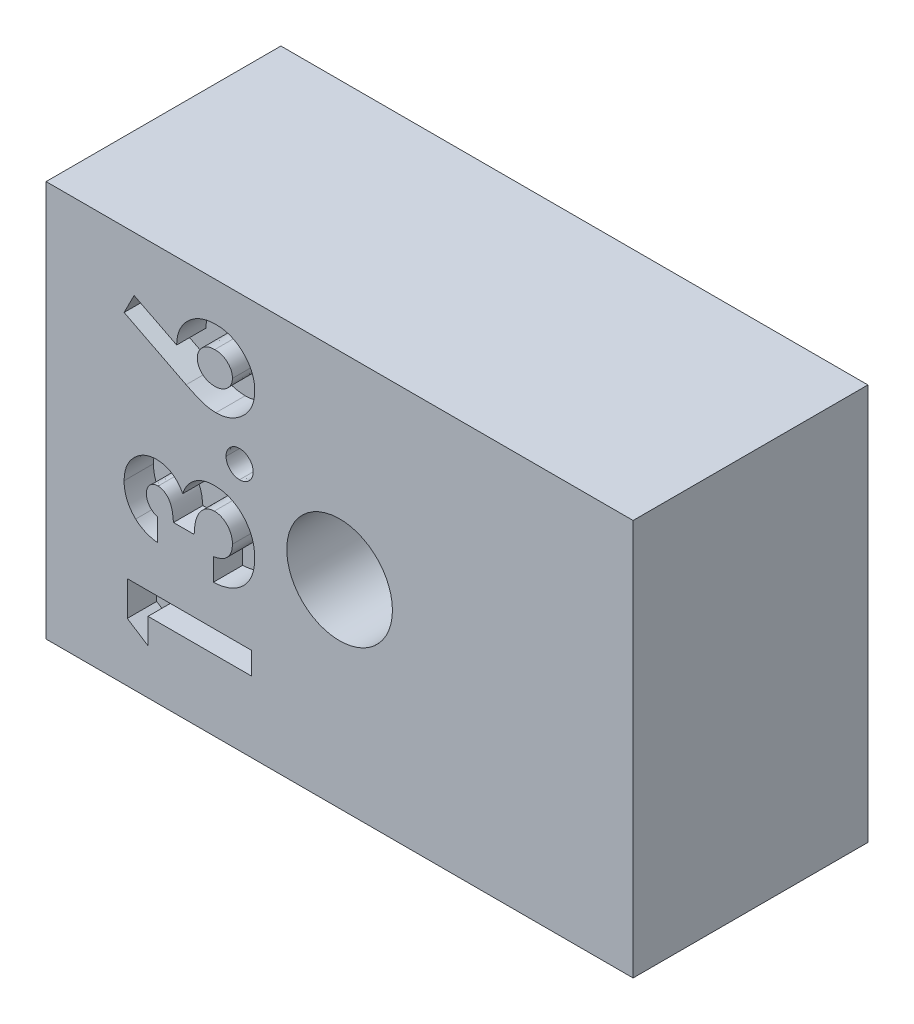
from build123d import *

# Parameters (mm, degrees)
SKETCH1_W           = 20
SKETCH1_H           = 13.5
SKETCH1_R           = 1.8
BOSS_EXTRUDE1_DEPTH = 8
CUT_EXTRUDE1_DEPTH  = 1


with BuildPart() as part:
    # Sketch1 → Boss-Extrude1 (new body)
    with BuildSketch(Plane.XY):
        with Locations((-2.245418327, -0.220916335)):
            Rectangle(SKETCH1_W, SKETCH1_H)
        with Locations((-2.245418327, -0.220916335)):
            Circle(SKETCH1_R, mode=Mode.SUBTRACT)
    extrude(amount=BOSS_EXTRUDE1_DEPTH)

    # Sketch3 → Cut-Extrude1 (cut)
    # profile 1 of 4: a face of its own
    with BuildSketch(Plane.XY.offset(8)):
        Polygon((-9.47875166, -4.97748017), (-9.47875166, -3.802967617), (-5.245418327, -3.802967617), (-5.245418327, -4.562796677), (-8.773196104, -4.562796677), (-8.773196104, -5.431172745), align=None)
    # profile 2 of 4: a face of its own
    with BuildSketch(Plane.XY.offset(8)):
        with BuildLine():
            Line((-8.447555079, -1.469206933), (-8.447555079, -2.229035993))
            add(Edge.make_bspline(
                [(-8.447555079, -2.229035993), (-8.485544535, -2.223704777), (-8.559747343, -2.213291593), (-8.667431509, -2.187693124), (-8.769831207, -2.158090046), (-8.866396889, -2.120231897), (-8.957024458, -2.076531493), (-9.041795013, -2.025570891), (-9.121925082, -1.969714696), (-9.169944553, -1.925982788), (-9.193815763, -1.904242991)],
                knots=[0, 0, 0, 0, 1.1115466, 2.171125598, 3.205689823, 4.19946166, 5.17440286, 6.118867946, 7.064860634, 8, 8, 8, 8], degree=3))
            add(Edge.make_bspline(
                [(-9.193815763, -1.904242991), (-9.225360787, -1.872963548), (-9.287532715, -1.811315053), (-9.367168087, -1.708293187), (-9.436087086, -1.600307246), (-9.490726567, -1.485191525), (-9.534950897, -1.36473731), (-9.564656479, -1.237986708), (-9.584366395, -1.105457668), (-9.586307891, -1.015023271), (-9.587298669, -0.968873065)],
                knots=[0, 0, 0, 0, 1.01925491, 2.00884431, 2.983262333, 3.955970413, 4.92937149, 5.924503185, 6.940838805, 8, 8, 8, 8], degree=3))
            add(Edge.make_bspline(
                [(-9.587298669, -0.968873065), (-9.586330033, -0.927843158), (-9.58442589, -0.847186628), (-9.569140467, -0.728641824), (-9.542331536, -0.615619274), (-9.50727946, -0.506924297), (-9.459585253, -0.404155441), (-9.40422243, -0.305044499), (-9.336317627, -0.212360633), (-9.259592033, -0.125886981), (-9.176605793, -0.046444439), (-9.087900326, 0.022353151), (-8.995845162, 0.081499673), (-8.899675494, 0.130228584), (-8.799228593, 0.167694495), (-8.695084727, 0.193696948), (-8.587473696, 0.210716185), (-8.514331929, 0.212411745), (-8.477235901, 0.2132717)],
                knots=[0, 0, 0, 0, 1.091422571, 2.145516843, 3.172569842, 4.178562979, 5.178154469, 6.181868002, 7.194278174, 8.227918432, 9.254613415, 10.245994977, 11.209837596, 12.161663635, 13.10878368, 14.055455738, 15.013766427, 16, 16, 16, 16], degree=3))
            add(Edge.make_bspline(
                [(-8.477235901, 0.2132717), (-8.431303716, 0.211473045), (-8.340600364, 0.207921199), (-8.208110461, 0.17983131), (-8.081714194, 0.134675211), (-7.962909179, 0.070469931), (-7.851819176, -0.010157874), (-7.75232406, -0.109032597), (-7.662882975, -0.223395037), (-7.614816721, -0.309246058), (-7.590203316, -0.353208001)],
                knots=[0, 0, 0, 0, 0.992776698, 1.96045919, 2.915875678, 3.886951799, 4.871409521, 5.874469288, 6.911574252, 8, 8, 8, 8], degree=3))
            add(Edge.make_bspline(
                [(-7.590203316, -0.353208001), (-7.580297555, -0.323032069), (-7.56083318, -0.263737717), (-7.522474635, -0.179474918), (-7.480644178, -0.099284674), (-7.431811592, -0.025000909), (-7.379361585, 0.045413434), (-7.320474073, 0.10973054), (-7.256660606, 0.16961588), (-7.187242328, 0.223587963), (-7.113373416, 0.271841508), (-7.036381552, 0.314366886), (-6.955985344, 0.35005367), (-6.872775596, 0.38000541), (-6.785933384, 0.402857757), (-6.695753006, 0.418935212), (-6.602451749, 0.428231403), (-6.539239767, 0.429648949), (-6.507277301, 0.430365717)],
                knots=[0, 0, 0, 0, 1.059375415, 2.081625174, 3.086260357, 4.075579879, 5.045586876, 6.014170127, 6.982201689, 7.963705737, 8.945119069, 9.924852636, 10.896327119, 11.878239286, 12.873838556, 13.889973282, 14.933087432, 16, 16, 16, 16], degree=3))
            add(Edge.make_bspline(
                [(-6.507277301, 0.430365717), (-6.460305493, 0.428912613), (-6.367686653, 0.426047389), (-6.231268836, 0.407831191), (-6.101205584, 0.373917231), (-5.976004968, 0.329297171), (-5.857266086, 0.269795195), (-5.742329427, 0.19971133), (-5.635092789, 0.1139265), (-5.533498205, 0.017726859), (-5.440682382, -0.088550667), (-5.358678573, -0.202912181), (-5.291079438, -0.325579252), (-5.233299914, -0.453586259), (-5.19041842, -0.589816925), (-5.15901572, -0.732509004), (-5.139909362, -0.882704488), (-5.137898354, -0.98521177), (-5.136871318, -1.037562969)],
                knots=[0, 0, 0, 0, 1.005228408, 1.982105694, 2.937129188, 3.876607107, 4.82066901, 5.774063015, 6.75178259, 7.752926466, 8.764612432, 9.766578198, 10.757677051, 11.756882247, 12.76686714, 13.807379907, 14.880213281, 16, 16, 16, 16], degree=3))
            add(Edge.make_bspline(
                [(-5.136871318, -1.037562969), (-5.137951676, -1.087087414), (-5.140064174, -1.183925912), (-5.158348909, -1.325572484), (-5.187843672, -1.460194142), (-5.229418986, -1.588134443), (-5.283335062, -1.708898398), (-5.347537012, -1.82358114), (-5.425727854, -1.929894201), (-5.514377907, -2.029022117), (-5.613838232, -2.118765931), (-5.72180488, -2.198975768), (-5.838688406, -2.267882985), (-5.963989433, -2.325770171), (-6.097927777, -2.372184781), (-6.240231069, -2.408796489), (-6.391177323, -2.434370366), (-6.495031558, -2.442158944), (-6.547982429, -2.44613001)],
                knots=[0, 0, 0, 0, 1.066544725, 2.085487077, 3.070979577, 4.031932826, 4.977951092, 5.916076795, 6.857635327, 7.814973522, 8.776389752, 9.738577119, 10.707772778, 11.69409279, 12.707140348, 13.757286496, 14.856535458, 16, 16, 16, 16], degree=3))
            Line((-6.547982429, -2.44613001), (-6.547982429, -1.68630095))
            add(Edge.make_bspline(
                [(-6.547982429, -1.68630095), (-6.52135848, -1.681485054), (-6.469501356, -1.672104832), (-6.394416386, -1.653825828), (-6.325135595, -1.629943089), (-6.261149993, -1.60263803), (-6.201802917, -1.572449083), (-6.148681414, -1.536378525), (-6.099697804, -1.497702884), (-6.043394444, -1.439564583), (-5.984348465, -1.358448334), (-5.932054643, -1.248621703), (-5.902313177, -1.125892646), (-5.898612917, -1.040266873), (-5.896700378, -0.996009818)],
                knots=[0, 0, 0, 0, 0.928450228, 1.808400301, 2.64896863, 3.43999153, 4.194978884, 4.9294959, 5.640047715, 6.332896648, 7.70085756, 9.063442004, 10.482192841, 12, 12, 12, 12], degree=3))
            add(Edge.make_bspline(
                [(-5.896700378, -0.996009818), (-5.897105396, -0.972522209), (-5.897898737, -0.926515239), (-5.90661203, -0.858920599), (-5.921129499, -0.794593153), (-5.940323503, -0.732998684), (-5.96636966, -0.675105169), (-5.996596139, -0.619601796), (-6.033597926, -0.567503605), (-6.075757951, -0.519114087), (-6.120777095, -0.474079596), (-6.170039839, -0.435625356), (-6.221180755, -0.40242589), (-6.275552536, -0.376229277), (-6.33143876, -0.354304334), (-6.390615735, -0.340630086), (-6.451798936, -0.330367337), (-6.493662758, -0.329767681), (-6.514909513, -0.329463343)],
                knots=[0, 0, 0, 0, 1.110702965, 2.175618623, 3.217100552, 4.227908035, 5.221854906, 6.215531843, 7.213608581, 8.237687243, 9.249555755, 10.220750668, 11.188994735, 12.127982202, 13.071814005, 14.022160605, 14.996205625, 16, 16, 16, 16], degree=3))
            add(Edge.make_bspline(
                [(-6.514909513, -0.329463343), (-6.538154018, -0.330237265), (-6.584150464, -0.331768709), (-6.651556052, -0.345245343), (-6.716645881, -0.365417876), (-6.778882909, -0.394429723), (-6.837901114, -0.432393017), (-6.894189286, -0.478552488), (-6.94729928, -0.533325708), (-6.998777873, -0.594878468), (-7.043841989, -0.665694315), (-7.085339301, -0.742913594), (-7.11838139, -0.828438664), (-7.147886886, -0.920217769), (-7.169439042, -1.019976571), (-7.185087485, -1.127098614), (-7.196735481, -1.241410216), (-7.198406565, -1.320206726), (-7.199264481, -1.360659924)],
                knots=[0, 0, 0, 0, 0.809868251, 1.602574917, 2.388262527, 3.182133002, 3.988875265, 4.829537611, 5.714850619, 6.646378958, 7.622533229, 8.636771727, 9.698525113, 10.814716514, 11.996253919, 13.252421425, 14.589425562, 16, 16, 16, 16], degree=3))
            Line((-7.199264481, -1.360659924), (-7.904820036, -1.360659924))
            add(Edge.make_bspline(
                [(-7.904820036, -1.360659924), (-7.909093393, -1.310287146), (-7.917087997, -1.216049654), (-7.936046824, -1.085332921), (-7.960572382, -0.974911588), (-7.992535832, -0.883523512), (-8.029871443, -0.806384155), (-8.073131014, -0.739941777), (-8.122806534, -0.681972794), (-8.178825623, -0.634290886), (-8.237545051, -0.594555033), (-8.299996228, -0.567353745), (-8.363694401, -0.549121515), (-8.407294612, -0.547406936), (-8.428898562, -0.54655736)],
                knots=[0, 0, 0, 0, 1.700711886, 3.181695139, 4.441392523, 5.500267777, 6.431839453, 7.31822765, 8.161090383, 8.990537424, 9.787217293, 10.536619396, 11.274893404, 12, 12, 12, 12], degree=3))
            add(Edge.make_bspline(
                [(-8.428898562, -0.54655736), (-8.456465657, -0.548017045), (-8.510270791, -0.550866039), (-8.587414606, -0.573426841), (-8.656546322, -0.611713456), (-8.716892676, -0.663662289), (-8.766117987, -0.727481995), (-8.802728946, -0.801341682), (-8.824086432, -0.88486709), (-8.826316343, -0.943590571), (-8.827469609, -0.973961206)],
                knots=[0, 0, 0, 0, 1.009324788, 1.969988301, 2.915956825, 3.885795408, 4.868116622, 5.850437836, 6.888288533, 8, 8, 8, 8], degree=3))
            add(Edge.make_bspline(
                [(-8.827469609, -0.973961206), (-8.826114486, -1.00149203), (-8.823425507, -1.056121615), (-8.80335568, -1.136006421), (-8.769570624, -1.211870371), (-8.722983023, -1.282142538), (-8.667033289, -1.345808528), (-8.600772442, -1.398059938), (-8.528170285, -1.441520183), (-8.474532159, -1.459941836), (-8.447555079, -1.469206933)],
                knots=[0, 0, 0, 0, 0.98818071, 1.960853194, 2.938124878, 3.957524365, 4.978590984, 5.968022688, 6.978025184, 8, 8, 8, 8], degree=3))
        make_face()
    # profile 3 of 4: a face of its own
    with BuildSketch(Plane.XY.offset(8)):
        with BuildLine():
            add(Edge.make_bspline(
                [(-6.113794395, 1.48869905), (-6.112223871, 1.519410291), (-6.109127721, 1.579954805), (-6.082808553, 1.666609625), (-6.03994669, 1.74603747), (-5.981697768, 1.816135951), (-5.912144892, 1.87573132), (-5.832666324, 1.918750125), (-5.745754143, 1.945551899), (-5.685172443, 1.948509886), (-5.654165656, 1.950023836)],
                knots=[0, 0, 0, 0, 1.01719242, 2.005305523, 2.97459142, 3.994072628, 5.012345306, 5.994342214, 6.97346883, 8, 8, 8, 8], degree=3))
            add(Edge.make_bspline(
                [(-5.654165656, 1.950023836), (-5.623170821, 1.948472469), (-5.562341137, 1.945427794), (-5.475011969, 1.918978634), (-5.3952514, 1.875482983), (-5.324938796, 1.816214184), (-5.265965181, 1.746050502), (-5.221973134, 1.66684078), (-5.195862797, 1.57992863), (-5.192732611, 1.519401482), (-5.191144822, 1.48869905)],
                knots=[0, 0, 0, 0, 1.023125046, 2.0079595, 2.986698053, 4.008755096, 5.030812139, 6.001348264, 6.986182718, 8, 8, 8, 8], degree=3))
            add(Edge.make_bspline(
                [(-5.191144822, 1.48869905), (-5.192719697, 1.457989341), (-5.195824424, 1.397447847), (-5.222193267, 1.310400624), (-5.265671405, 1.230606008), (-5.325010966, 1.160425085), (-5.394999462, 1.10088971), (-5.475268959, 1.058613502), (-5.562307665, 1.031909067), (-5.623159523, 1.02890496), (-5.654165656, 1.027374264)],
                knots=[0, 0, 0, 0, 1.013339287, 1.99770941, 2.975986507, 3.997561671, 5.019136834, 5.992987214, 6.977357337, 8, 8, 8, 8], degree=3))
            add(Edge.make_bspline(
                [(-5.654165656, 1.027374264), (-5.685183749, 1.028867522), (-5.745787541, 1.031785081), (-5.832410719, 1.058839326), (-5.912395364, 1.100643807), (-5.981626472, 1.160502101), (-6.040238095, 1.230623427), (-6.082588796, 1.310628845), (-6.109165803, 1.397422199), (-6.112236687, 1.457980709), (-6.113794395, 1.48869905)],
                knots=[0, 0, 0, 0, 1.026040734, 2.004699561, 2.981785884, 3.999572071, 5.018566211, 5.995652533, 6.983293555, 8, 8, 8, 8], degree=3))
        make_face()
    # profile 4 of 4: a face of its own
    with BuildSketch(Plane.XY.offset(8)):
        with BuildLine():
            Line((-9.587298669, 3.995456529), (-9.24639322, 4.667939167))
            Line((-9.24639322, 4.667939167), (-7.796273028, 3.930158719))
            add(Edge.make_bspline(
                [(-7.796273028, 3.930158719), (-7.79515275, 3.973749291), (-7.79294618, 4.059608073), (-7.774863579, 4.185876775), (-7.744217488, 4.306898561), (-7.701449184, 4.422668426), (-7.647717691, 4.534013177), (-7.581591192, 4.640392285), (-7.50150113, 4.740389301), (-7.412602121, 4.83586979), (-7.314160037, 4.922707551), (-7.208368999, 4.998136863), (-7.097817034, 5.063873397), (-6.98002709, 5.114974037), (-6.856952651, 5.156193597), (-6.72810147, 5.185935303), (-6.593100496, 5.202903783), (-6.501388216, 5.20524317), (-6.454699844, 5.206434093)],
                knots=[0, 0, 0, 0, 1.013301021, 1.995862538, 2.958769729, 3.911210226, 4.860765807, 5.829243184, 6.816804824, 7.835209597, 8.859810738, 9.863084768, 10.852896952, 11.844649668, 12.842374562, 13.8676291, 14.914464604, 16, 16, 16, 16], degree=3))
            add(Edge.make_bspline(
                [(-6.454699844, 5.206434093), (-6.409696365, 5.205314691), (-6.320743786, 5.203102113), (-6.190072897, 5.184917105), (-6.064526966, 5.15520831), (-5.944476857, 5.113708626), (-5.829930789, 5.059496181), (-5.720264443, 4.994336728), (-5.616328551, 4.916346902), (-5.518769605, 4.827955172), (-5.429850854, 4.731309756), (-5.350812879, 4.629444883), (-5.285524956, 4.521491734), (-5.230387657, 4.409492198), (-5.189243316, 4.291383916), (-5.158186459, 4.168934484), (-5.140265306, 4.041215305), (-5.1380117, 3.9545228), (-5.136871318, 3.910654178)],
                knots=[0, 0, 0, 0, 1.049918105, 2.075237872, 3.072085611, 4.056810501, 5.033614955, 6.024683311, 7.028730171, 8.060902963, 9.092654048, 10.090156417, 11.064284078, 12.032024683, 12.998077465, 13.977262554, 14.976443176, 16, 16, 16, 16], degree=3))
            add(Edge.make_bspline(
                [(-5.136871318, 3.910654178), (-5.137815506, 3.864784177), (-5.139672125, 3.774587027), (-5.16015904, 3.642550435), (-5.191590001, 3.516223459), (-5.234278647, 3.395091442), (-5.292219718, 3.28066324), (-5.361648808, 3.171962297), (-5.444165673, 3.069422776), (-5.537299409, 2.973712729), (-5.639358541, 2.887502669), (-5.745311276, 2.810605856), (-5.855337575, 2.745552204), (-5.969316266, 2.692892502), (-6.086885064, 2.651806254), (-6.208266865, 2.623218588), (-6.333139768, 2.604591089), (-6.417885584, 2.60240744), (-6.460636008, 2.601305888)],
                knots=[0, 0, 0, 0, 1.063729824, 2.091680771, 3.092458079, 4.082252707, 5.065066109, 6.062289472, 7.070414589, 8.114214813, 9.156632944, 10.167081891, 11.149282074, 12.117871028, 13.076366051, 14.034232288, 15.008359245, 16, 16, 16, 16], degree=3))
            add(Edge.make_bspline(
                [(-6.460636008, 2.601305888), (-6.49374122, 2.601887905), (-6.560135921, 2.603055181), (-6.659558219, 2.614786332), (-6.759242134, 2.632620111), (-6.843356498, 2.653297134), (-6.914489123, 2.674575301), (-6.974669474, 2.696034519), (-7.041292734, 2.722340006), (-7.114600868, 2.753340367), (-7.195171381, 2.787749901), (-7.28205942, 2.827750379), (-7.375958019, 2.872039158), (-7.440429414, 2.903676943), (-7.474024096, 2.920162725)],
                knots=[0, 0, 0, 0, 1.110459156, 2.227099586, 3.354645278, 4.50724841, 5.131424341, 5.845429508, 6.650417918, 7.534765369, 8.5162346, 9.590157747, 10.744282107, 12, 12, 12, 12], degree=3))
            Line((-7.474024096, 2.920162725), (-9.587298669, 3.995456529))
        make_face()
        with BuildLine():
            add(Edge.make_bspline(
                [(-7.090717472, 3.893693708), (-7.089041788, 3.857237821), (-7.085762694, 3.785898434), (-7.051540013, 3.6844132), (-6.997689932, 3.5922506), (-6.92372873, 3.511527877), (-6.834032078, 3.444507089), (-6.731521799, 3.395638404), (-6.618057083, 3.365769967), (-6.538841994, 3.362713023), (-6.497949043, 3.361134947)],
                knots=[0, 0, 0, 0, 0.981531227, 1.92072777, 2.858278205, 3.847411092, 4.856727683, 5.864107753, 6.897395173, 8, 8, 8, 8], degree=3))
            add(Edge.make_bspline(
                [(-6.497949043, 3.361134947), (-6.457052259, 3.363028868), (-6.37750528, 3.36671267), (-6.263322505, 3.397243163), (-6.159400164, 3.448017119), (-6.068953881, 3.518675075), (-5.992780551, 3.601040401), (-5.937207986, 3.693305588), (-5.902970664, 3.792700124), (-5.898804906, 3.861486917), (-5.896700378, 3.896237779)],
                knots=[0, 0, 0, 0, 1.098517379, 2.136689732, 3.153260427, 4.188757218, 5.205896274, 6.153740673, 7.067275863, 8, 8, 8, 8], degree=3))
            add(Edge.make_bspline(
                [(-5.896700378, 3.896237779), (-5.898845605, 3.932935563), (-5.903052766, 4.004906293), (-5.935804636, 4.10873196), (-5.990533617, 4.203564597), (-6.065532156, 4.287465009), (-6.155032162, 4.359182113), (-6.25973197, 4.409690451), (-6.375124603, 4.441339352), (-6.456182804, 4.444814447), (-6.497949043, 4.446605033)],
                knots=[0, 0, 0, 0, 0.969156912, 1.90068503, 2.84824055, 3.843957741, 4.860802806, 5.860356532, 6.897522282, 8, 8, 8, 8], degree=3))
            add(Edge.make_bspline(
                [(-6.497949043, 4.446605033), (-6.538818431, 4.444629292), (-6.617966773, 4.440803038), (-6.731956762, 4.411660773), (-6.834084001, 4.360449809), (-6.924103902, 4.291902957), (-6.998015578, 4.208425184), (-7.051966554, 4.112561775), (-7.085701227, 4.006440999), (-7.089021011, 3.931824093), (-7.090717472, 3.893693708)],
                knots=[0, 0, 0, 0, 1.082993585, 2.097343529, 3.092828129, 4.092676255, 5.080456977, 6.026823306, 6.991676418, 8, 8, 8, 8], degree=3))
        make_face(mode=Mode.SUBTRACT)
    extrude(amount=-CUT_EXTRUDE1_DEPTH, mode=Mode.SUBTRACT)


solid = part.part
